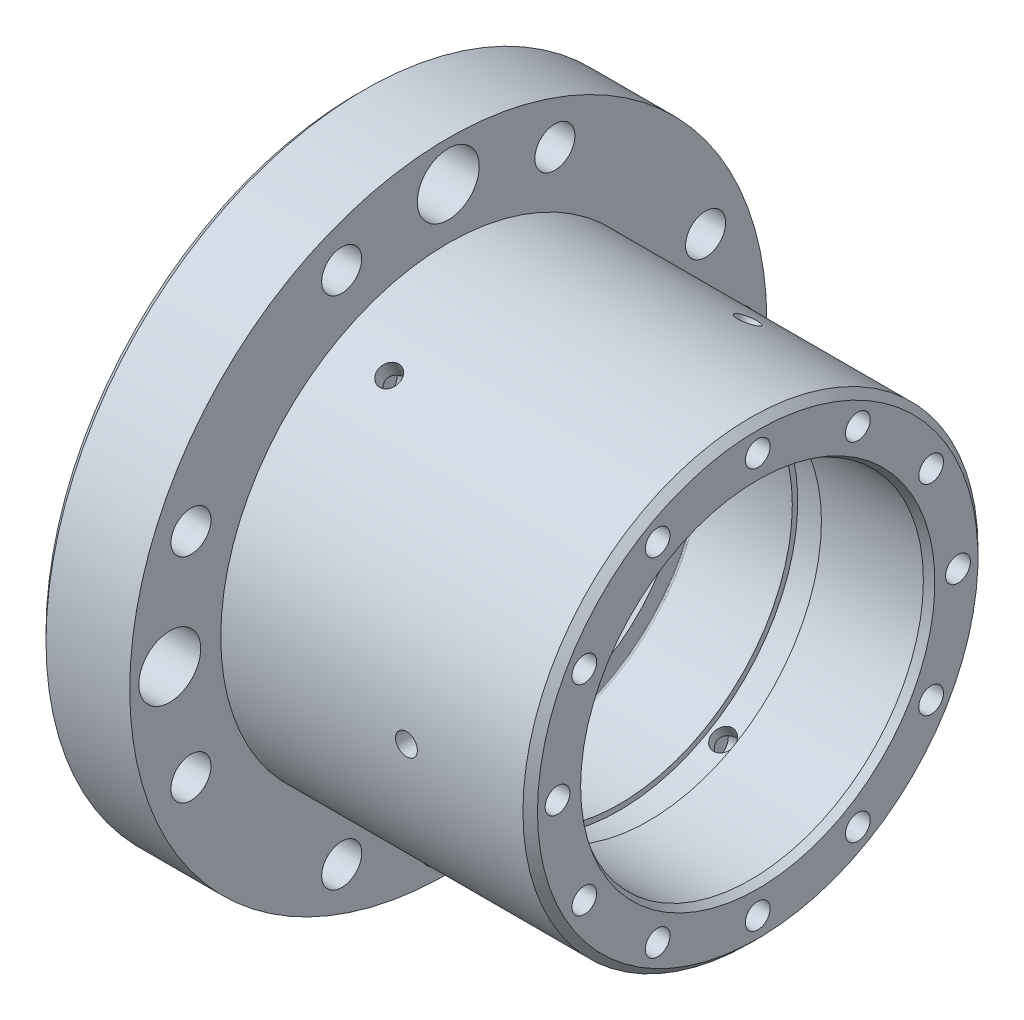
from build123d import *

# Parameters (mm, degrees)
ESQUISSE2_R                            = 8.5
EXTRUSION1_DEPTH                       = 62
ESQUISSE3_R                            = 8.5
EXTRUSION2_DEPTH                       = 10
ESQUISSE4_R                            = 5.5
EXTRUSION3_DEPTH                       = 21
R_P_TITION_CIRCULAIRE1_COUNT           = 2
R_P_TITION_CIRCULAIRE1_ANGLE           = 45
R_P_TITION_CIRCULAIRE2_COUNT           = 4
R_P_TITION_CIRCULAIRE2_COPY_1_SKETCH_R = 8.5
R_P_TITION_CIRCULAIRE2_COPY_1_DEPTH    = 10
R_P_TITION_CIRCULAIRE2_COPY_2_SKETCH_R = 8.5
R_P_TITION_CIRCULAIRE2_COPY_2_DEPTH    = 10
R_P_TITION_CIRCULAIRE2_COPY_3_SKETCH_R = 8.5
R_P_TITION_CIRCULAIRE2_COPY_3_DEPTH    = 10
R_P_TITION_CIRCULAIRE2_COPY_4_SKETCH_R = 5.5
R_P_TITION_CIRCULAIRE2_COPY_4_DEPTH    = 21
R_P_TITION_CIRCULAIRE2_COPY_5_SKETCH_R = 5.5
R_P_TITION_CIRCULAIRE2_COPY_5_DEPTH    = 21
R_P_TITION_CIRCULAIRE2_COPY_6_SKETCH_R = 5.5
R_P_TITION_CIRCULAIRE2_COPY_6_DEPTH    = 21
R_P_TITION_CIRCULAIRE3_COUNT           = 3
R_P_TITION_CIRCULAIRE4_COUNT           = 6
ESQUISSE10_R                           = 3.4
EXTRUSION4_DEPTH                       = 75
R_P_TITION_CIRCULAIRE5_COUNT           = 3
ESQUISSE11_R                           = 3
EXTRUSION5_DEPTH                       = 34
ESQUISSE12_R                           = 3
EXTRUSION6_DEPTH                       = 34
ESQUISSE13_R                           = 3.4
EXTRUSION7_DEPTH                       = 39
R_P_TITION_CIRCULAIRE6_COUNT           = 3
R_P_TITION_CIRCULAIRE7_COUNT           = 3


with BuildPart() as part:
    # Esquisse1 → R_volution1 (revolve)
    with BuildSketch(Plane(origin=(0, 0, 0), x_dir=(1, 0, 0), z_dir=(0, 1, 0)), mode=Mode.PRIVATE) as r_volution1_sk:
        with BuildLine():
            Line((-52.750675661, 100.253041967), (-52.750675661, 72.253041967))
            Line((-52.750675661, 72.253041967), (-47.750675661, 72.253041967))
            Line((-47.750675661, 72.253041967), (-47.750675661, 58.119067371))
            Line((-47.750675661, 58.119067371), (-46.250675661, 57.253041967))
            Line((-46.250675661, 57.253041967), (-23.150675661, 57.253041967))
            ThreePointArc((-23.150675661, 57.253041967), (-22.867832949, 57.135884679), (-22.750675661, 56.853041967))
            Line((-22.750675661, 56.853041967), (-22.750675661, 55.753041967))
            Line((-22.750675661, 55.753041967), (-8.250675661, 55.753041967))
            Line((-8.250675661, 55.753041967), (-5.750675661, 57.19641764))
            Line((-5.750675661, 57.19641764), (-5.750675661, 61.853041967))
            ThreePointArc((-5.750675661, 61.853041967), (-5.633518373, 62.135884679), (-5.350675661, 62.253041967))
            Line((-5.350675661, 62.253041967), (19.249324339, 62.253041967))
            Line((19.249324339, 62.253041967), (19.249324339, 63.753041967))
            Line((19.249324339, 63.753041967), (27.249324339, 63.753041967))
            Line((27.249324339, 63.753041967), (27.249324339, 62.253041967))
            Line((27.249324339, 62.253041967), (55.249324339, 62.253041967))
            Line((55.249324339, 62.253041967), (57.249324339, 63.407742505))
            Line((57.249324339, 63.407742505), (57.249324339, 75.253041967))
            Line((57.249324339, 75.253041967), (55.249324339, 77.253041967))
            Line((55.249324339, 77.253041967), (-27.750675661, 77.253041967))
            Line((-27.750675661, 77.253041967), (-27.750675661, 102.253041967))
            Line((-27.750675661, 102.253041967), (-50.750675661, 102.253041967))
            Line((-50.750675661, 102.253041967), (-52.750675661, 100.253041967))
        make_face()
    revolve(r_volution1_sk.sketch.rotate(Axis((-52.750675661, 0, -14.753041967), (1, 0, 0)), 180), axis=Axis((-52.750675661, 0, -14.753041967), (1, 0, 0)))

    # Esquisse2 → Extrusion1 (cut)
    with BuildSketch(Plane.ZY.offset(52.750675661)):
        with Locations((-14.753041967, 76.5)):
            Circle(ESQUISSE2_R)
        with Locations((61.746958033, 0)):
            Circle(ESQUISSE2_R)
        with Locations((-14.753041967, -76.5)):
            Circle(ESQUISSE2_R)
        with Locations((-91.253041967, 0)):
            Circle(ESQUISSE2_R)
    extrude(amount=-EXTRUSION1_DEPTH, mode=Mode.SUBTRACT)

    # Esquisse3 → Extrusion2 (cut)
    with BuildSketch(Plane.ZY.offset(52.750675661)):
        with Locations((-44.028324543, 70.676784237)):
            Circle(ESQUISSE3_R)
    extrusion2 = extrude(amount=-EXTRUSION2_DEPTH, mode=Mode.SUBTRACT)

    # Esquisse4 → Extrusion3 (cut)
    with BuildSketch(Plane.ZY.offset(42.750675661)):
        with Locations((-44.028324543, 70.676784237)):
            Circle(ESQUISSE4_R)
    extrusion3 = extrude(amount=-EXTRUSION3_DEPTH, mode=Mode.SUBTRACT)

    # R_p_tition circulaire1: Extrusion2, Extrusion3 ×2 about axis
    r_p_tition_circulaire1_axis = Axis((-47.750675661, 0, -14.753041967), (1, 0, 0))
    add([extrusion2.rotate(r_p_tition_circulaire1_axis, i * R_P_TITION_CIRCULAIRE1_ANGLE / (R_P_TITION_CIRCULAIRE1_COUNT - 1)) for i in range(1, R_P_TITION_CIRCULAIRE1_COUNT)], mode=Mode.SUBTRACT)
    add([extrusion3.rotate(r_p_tition_circulaire1_axis, i * R_P_TITION_CIRCULAIRE1_ANGLE / (R_P_TITION_CIRCULAIRE1_COUNT - 1)) for i in range(1, R_P_TITION_CIRCULAIRE1_COUNT)], mode=Mode.SUBTRACT)

    # R_p_tition circulaire2: Extrusion2, Extrusion3 ×4 about axis
    r_p_tition_circulaire2_axis = Axis((0, 0, -14.753041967), (1, 0, 0))
    add([extrusion2.rotate(r_p_tition_circulaire2_axis, i * 360 / R_P_TITION_CIRCULAIRE2_COUNT) for i in range(1, R_P_TITION_CIRCULAIRE2_COUNT)], mode=Mode.SUBTRACT)
    add([extrusion3.rotate(r_p_tition_circulaire2_axis, i * 360 / R_P_TITION_CIRCULAIRE2_COUNT) for i in range(1, R_P_TITION_CIRCULAIRE2_COUNT)], mode=Mode.SUBTRACT)

    # R_p_tition circulaire2 copy 1 sketch → R_p_tition circulaire2 copy 1 (cut)
    with BuildSketch(Plane(origin=(-52.750675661, -10.431976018, -25.185017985), x_dir=(0, -0.7071067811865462, -0.7071067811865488), z_dir=(-1, 0, 0))):
        with Locations((-44.028324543, 70.676784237)):
            Circle(R_P_TITION_CIRCULAIRE2_COPY_1_SKETCH_R)
    extrude(amount=-R_P_TITION_CIRCULAIRE2_COPY_1_DEPTH, mode=Mode.SUBTRACT)

    # R_p_tition circulaire2 copy 2 sketch → R_p_tition circulaire2 copy 2 (cut)
    with BuildSketch(Plane(origin=(-52.750675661, 10.431976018, -25.185017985), x_dir=(0, 0.7071067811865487, -0.7071067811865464), z_dir=(-1, 0, 0))):
        with Locations((-44.028324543, 70.676784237)):
            Circle(R_P_TITION_CIRCULAIRE2_COPY_2_SKETCH_R)
    extrude(amount=-R_P_TITION_CIRCULAIRE2_COPY_2_DEPTH, mode=Mode.SUBTRACT)

    # R_p_tition circulaire2 copy 3 sketch → R_p_tition circulaire2 copy 3 (cut)
    with BuildSketch(Plane(origin=(-52.750675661, 10.431976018, -4.321065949), x_dir=(0, 0.7071067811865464, 0.7071067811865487), z_dir=(-1, 0, 0))):
        with Locations((-44.028324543, 70.676784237)):
            Circle(R_P_TITION_CIRCULAIRE2_COPY_3_SKETCH_R)
    extrude(amount=-R_P_TITION_CIRCULAIRE2_COPY_3_DEPTH, mode=Mode.SUBTRACT)

    # R_p_tition circulaire2 copy 4 sketch → R_p_tition circulaire2 copy 4 (cut)
    with BuildSketch(Plane(origin=(-42.750675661, -10.431976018, -25.185017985), x_dir=(0, -0.7071067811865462, -0.7071067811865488), z_dir=(-1, 0, 0))):
        with Locations((-44.028324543, 70.676784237)):
            Circle(R_P_TITION_CIRCULAIRE2_COPY_4_SKETCH_R)
    extrude(amount=-R_P_TITION_CIRCULAIRE2_COPY_4_DEPTH, mode=Mode.SUBTRACT)

    # R_p_tition circulaire2 copy 5 sketch → R_p_tition circulaire2 copy 5 (cut)
    with BuildSketch(Plane(origin=(-42.750675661, 10.431976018, -25.185017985), x_dir=(0, 0.7071067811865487, -0.7071067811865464), z_dir=(-1, 0, 0))):
        with Locations((-44.028324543, 70.676784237)):
            Circle(R_P_TITION_CIRCULAIRE2_COPY_5_SKETCH_R)
    extrude(amount=-R_P_TITION_CIRCULAIRE2_COPY_5_DEPTH, mode=Mode.SUBTRACT)

    # R_p_tition circulaire2 copy 6 sketch → R_p_tition circulaire2 copy 6 (cut)
    with BuildSketch(Plane(origin=(-42.750675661, 10.431976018, -4.321065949), x_dir=(0, 0.7071067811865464, 0.7071067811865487), z_dir=(-1, 0, 0))):
        with Locations((-44.028324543, 70.676784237)):
            Circle(R_P_TITION_CIRCULAIRE2_COPY_6_SKETCH_R)
    extrude(amount=-R_P_TITION_CIRCULAIRE2_COPY_6_DEPTH, mode=Mode.SUBTRACT)

    # Esquisse6 → Trou taraud_ M61 (revolve, cut)
    with BuildSketch(Plane(origin=(-47.750675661, 48.5, -14.753041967), x_dir=(0, 0, 1), z_dir=(0, 1, 0))):
        Polygon((0, 0), (0, 19.502151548), (2.5, 18), (2.5, 0), align=None)
    trou_taraud_m61 = revolve(axis=Axis((-54.100675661, 48.5, -14.753041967), (1, 0, 0)), mode=Mode.SUBTRACT)

    # R_p_tition circulaire3: Trou taraud_ M61 ×3 about axis
    r_p_tition_circulaire3_axis = Axis((0, 0, -14.753041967), (1, 0, 0))
    for i in range(1, R_P_TITION_CIRCULAIRE3_COUNT):
        add(trou_taraud_m61.rotate(r_p_tition_circulaire3_axis, i * 360 / R_P_TITION_CIRCULAIRE3_COUNT), mode=Mode.SUBTRACT)

    # Esquisse9 → Trou taraud_ M81 (revolve, cut)
    with BuildSketch(Plane(origin=(57.249324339, 55, -14.753041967), x_dir=(0, 0, -1), z_dir=(0, 1, 0))):
        Polygon((0, 0), (0, 21.792926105), (3.4, 19.75), (3.4, 0), align=None)
    trou_taraud_m81 = revolve(axis=Axis((63.599324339, 55, -14.753041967), (-1, 0, 0)), mode=Mode.SUBTRACT)

    # R_p_tition circulaire4: Trou taraud_ M81 ×6 about axis
    r_p_tition_circulaire4_axis = Axis((0, 0, -14.753041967), (1, 0, 0))
    for i in range(1, R_P_TITION_CIRCULAIRE4_COUNT):
        add(trou_taraud_m81.rotate(r_p_tition_circulaire4_axis, i * 360 / R_P_TITION_CIRCULAIRE4_COUNT), mode=Mode.SUBTRACT)

    # Esquisse10 → Extrusion4 (cut)
    with BuildSketch(Plane(origin=(57.249324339, 0, 0), x_dir=(0, 0, -1), z_dir=(1, 0, 0))):
        with Locations((-12.746958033, 47.631397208)):
            Circle(ESQUISSE10_R)
    extrusion4 = extrude(amount=-EXTRUSION4_DEPTH, mode=Mode.SUBTRACT)

    # R_p_tition circulaire5: Extrusion4 ×3 about axis
    r_p_tition_circulaire5_axis = Axis((0, 0, -14.753041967), (1, 0, 0))
    for i in range(1, R_P_TITION_CIRCULAIRE5_COUNT):
        add(extrusion4.rotate(r_p_tition_circulaire5_axis, i * 360 / R_P_TITION_CIRCULAIRE5_COUNT), mode=Mode.SUBTRACT)

    # Esquisse11 → Extrusion5 (cut)
    with BuildSketch(Plane(origin=(13.749324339, 54.126587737, 16.496958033), x_dir=(0, 0.49999999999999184, -0.8660254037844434), z_dir=(0, 0.8660254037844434, 0.49999999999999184))):
        with Locations(Location((0, 26.5, 0), (0, 0, 180))):
            Circle(ESQUISSE11_R)
    extrusion5 = extrude(amount=-EXTRUSION5_DEPTH, mode=Mode.SUBTRACT)

    # Esquisse12 → Extrusion6 (cut)
    with BuildSketch(Plane(origin=(13.749324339, 54.126587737, -46.003041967), x_dir=(0, -0.5000000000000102, -0.8660254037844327), z_dir=(0, 0.8660254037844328, -0.5000000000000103))):
        with Locations(Location((0, -9.5, 0), (0, 0, 180))):
            Circle(ESQUISSE12_R)
    extrusion6 = extrude(amount=-EXTRUSION6_DEPTH, mode=Mode.SUBTRACT)

    # Esquisse13 → Extrusion7 (cut)
    with BuildSketch(Plane(origin=(57.249324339, 0, 0), x_dir=(0, 0, -1), z_dir=(1, 0, 0))):
        with Locations((42.253041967, 47.631397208)):
            Circle(ESQUISSE13_R)
    extrusion7 = extrude(amount=-EXTRUSION7_DEPTH, mode=Mode.SUBTRACT)

    # R_p_tition circulaire6: Extrusion6, Extrusion7 ×3 about axis
    r_p_tition_circulaire6_axis = Axis((0, 0, -14.753041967), (1, 0, 0))
    add([extrusion6.rotate(r_p_tition_circulaire6_axis, i * 360 / R_P_TITION_CIRCULAIRE6_COUNT) for i in range(1, R_P_TITION_CIRCULAIRE6_COUNT)], mode=Mode.SUBTRACT)
    add([extrusion7.rotate(r_p_tition_circulaire6_axis, i * 360 / R_P_TITION_CIRCULAIRE6_COUNT) for i in range(1, R_P_TITION_CIRCULAIRE6_COUNT)], mode=Mode.SUBTRACT)

    # R_p_tition circulaire7: Extrusion5 ×3 about axis
    r_p_tition_circulaire7_axis = Axis((55.249324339, 0, -14.753041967), (-1, 0, 0))
    for i in range(1, R_P_TITION_CIRCULAIRE7_COUNT):
        add(extrusion5.rotate(r_p_tition_circulaire7_axis, i * 360 / R_P_TITION_CIRCULAIRE7_COUNT), mode=Mode.SUBTRACT)


solid = part.part
